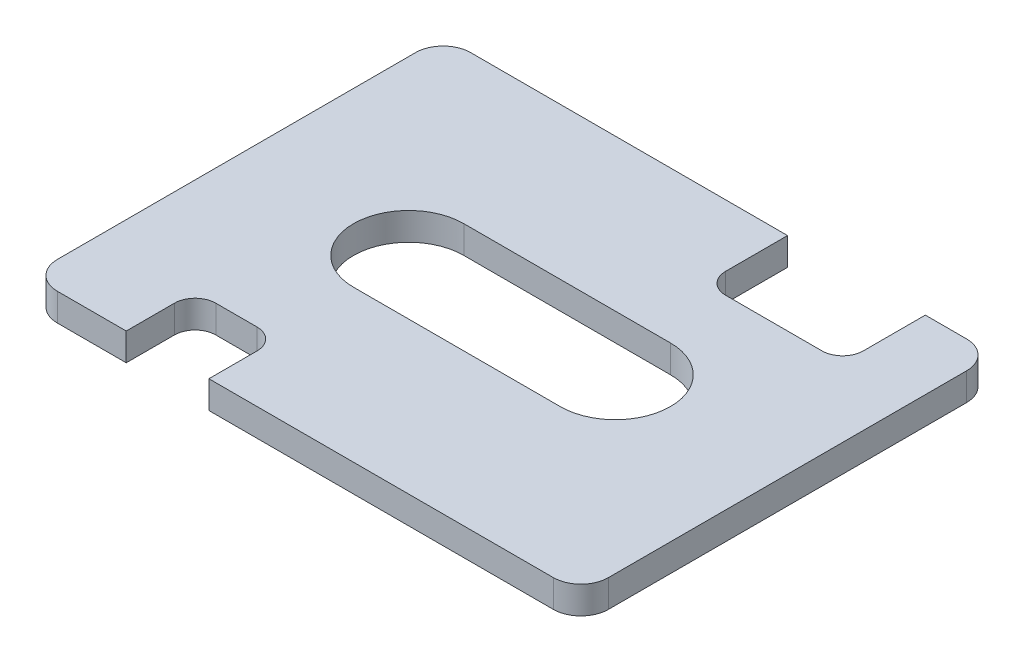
from build123d import *

# Parameters (mm, degrees)
SKETCH1_W           = 200
SKETCH1_H           = 150
BOSS_EXTRUDE1_DEPTH = 10
SKETCH2_W           = 30
SKETCH2_H           = 50
CUT_EXTRUDE1_DEPTH  = 126.39936204
SKETCH3_W           = 50
SKETCH3_H           = 60
CUT_EXTRUDE2_DEPTH  = 126.39936204
CUT_EXTRUDE3_DEPTH  = 126.39936204
FILLET1_R           = 7.5
FILLET2_R           = 10


with BuildPart() as part:
    # Sketch1 → Boss-Extrude1 (new body)
    with BuildSketch(Plane(origin=(0, 0, 0), x_dir=(1, 0, 0), z_dir=(0, 1, 0))):
        Rectangle(SKETCH1_W, SKETCH1_H)
    extrude(amount=BOSS_EXTRUDE1_DEPTH)

    # Sketch2 → Cut-Extrude1 (cut, through all)
    with BuildSketch(Plane(origin=(0, 10, 0), x_dir=(1, 0, 0), z_dir=(0, 1, 0))):
        with Locations((-50, -75)):
            Rectangle(SKETCH2_W, SKETCH2_H)
    extrude(amount=-CUT_EXTRUDE1_DEPTH, mode=Mode.SUBTRACT)

    # Sketch3 → Cut-Extrude2 (cut, through all)
    with BuildSketch(Plane(origin=(0, 10, 0), x_dir=(1, 0, 0), z_dir=(0, 1, 0))):
        with Locations((50, 75)):
            Rectangle(SKETCH3_W, SKETCH3_H)
    extrude(amount=-CUT_EXTRUDE2_DEPTH, mode=Mode.SUBTRACT)

    # Sketch4 → Cut-Extrude3 (cut, through all)
    with BuildSketch(Plane(origin=(0, 10, 0), x_dir=(1, 0, 0), z_dir=(0, 1, 0))):
        with BuildLine():
            Line((-37.5, 20), (37.5, 20))
            ThreePointArc((37.5, 20), (57.5, 0), (37.5, -20))
            Line((37.5, -20), (-37.5, -20))
            ThreePointArc((-37.5, -20), (-57.5, 0), (-37.5, 20))
        make_face()
    extrude(amount=-CUT_EXTRUDE3_DEPTH, mode=Mode.SUBTRACT)

    # Fillet1
    fillet1_edges = [part.edges().sort_by_distance(p)[0] for p in [
        (-35, 5, 50),
        (-65, 5, 50),
        (25, 5, -45),
        (75, 5, -45),
    ]]
    fillet(fillet1_edges, radius=FILLET1_R)

    # Fillet2
    fillet2_edges = [part.edges().sort_by_distance(p)[0] for p in [
        (100, 5, 75),
        (-100, 5, 75),
        (-100, 5, -75),
        (100, 5, -75),
    ]]
    fillet(fillet2_edges, radius=FILLET2_R)


solid = part.part
